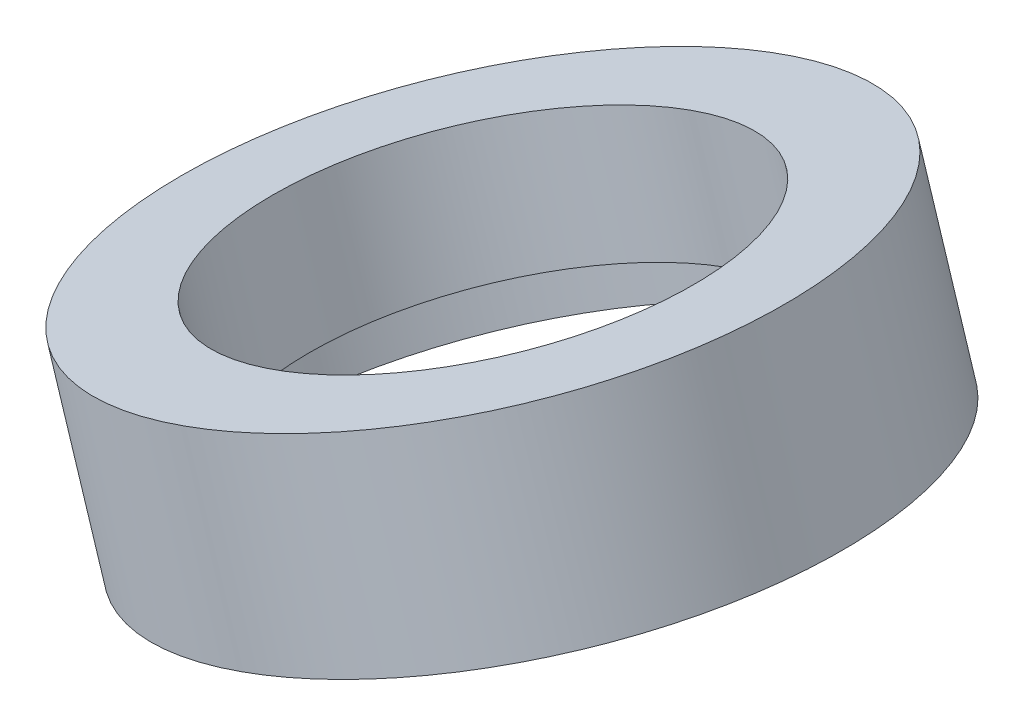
from build123d import *


with BuildPart() as part:
    # Sk_Cazoleta → Cazoleta (revolve)
    with BuildSketch(Plane.XY, mode=Mode.PRIVATE) as cazoleta_sk:
        Polygon((373.42025708, 555.043071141), (379.333285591, 556.907499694), (383.092214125, 544.986071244), (382.233871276, 544.71542839), (380.880657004, 549.007142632), (375.825971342, 547.413356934), align=None)
    revolve(cazoleta_sk.sketch.rotate(Axis((358.278571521, 555.511428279, 0), (0.3007142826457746, -0.9537142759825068, 0)), 180), axis=Axis((358.278571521, 555.511428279, 0), (0.3007142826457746, -0.9537142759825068, 0)))


solid = part.part
